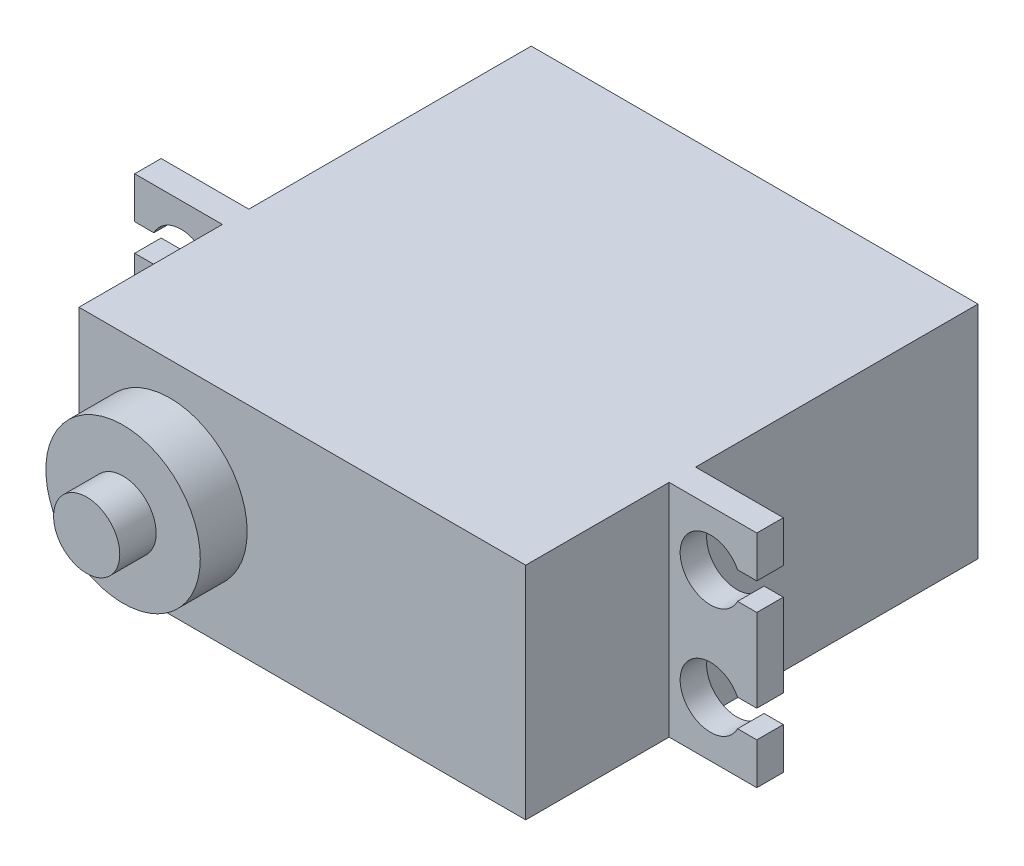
ISO-10303-21;
HEADER;
FILE_DESCRIPTION(('STEP AP214'),'2;1');
FILE_NAME('part.step','',(''),(''),'','','');
FILE_SCHEMA(('AUTOMOTIVE_DESIGN { 1 0 10303 214 1 1 1 1 }'));
ENDSEC;
DATA;
#1=APPLICATION_CONTEXT('core data for automotive mechanical design processes');
#2=APPLICATION_PROTOCOL_DEFINITION('international standard','automotive_design',2000,#1);
#3=PRODUCT_CONTEXT('',#1,'mechanical');
#4=PRODUCT('Part','Part','',(#3));
#5=PRODUCT_RELATED_PRODUCT_CATEGORY('part','',(#4));
#6=PRODUCT_DEFINITION_FORMATION('','',#4);
#7=PRODUCT_DEFINITION_CONTEXT('part definition',#1,'design');
#8=PRODUCT_DEFINITION('design','',#6,#7);
#9=PRODUCT_DEFINITION_SHAPE('','',#8);
#10=(LENGTH_UNIT() NAMED_UNIT(*) SI_UNIT(.MILLI.,.METRE.));
#11=(NAMED_UNIT(*) PLANE_ANGLE_UNIT() SI_UNIT($,.RADIAN.));
#12=(NAMED_UNIT(*) SI_UNIT($,.STERADIAN.) SOLID_ANGLE_UNIT());
#13=UNCERTAINTY_MEASURE_WITH_UNIT(LENGTH_MEASURE(1.E-05),#10,'distance_accuracy_value','');
#14=(GEOMETRIC_REPRESENTATION_CONTEXT(3) GLOBAL_UNCERTAINTY_ASSIGNED_CONTEXT((#13)) GLOBAL_UNIT_ASSIGNED_CONTEXT((#10,
#11,#12)) REPRESENTATION_CONTEXT('',''));
#15=CARTESIAN_POINT('',(0.,0.,0.));
#16=DIRECTION('',(0.,0.,1.));
#17=DIRECTION('',(1.,0.,0.));
#18=AXIS2_PLACEMENT_3D('',#15,#16,#17);
#19=CARTESIAN_POINT('',(28.2,18.3043663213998,28.));
#20=DIRECTION('',(1.,0.,0.));
#21=DIRECTION('',(0.,0.,-1.));
#22=AXIS2_PLACEMENT_3D('',#19,#20,#21);
#23=PLANE('',#22);
#24=DIRECTION('',(0.,0.,1.));
#25=VECTOR('',#24,1.);
#26=CARTESIAN_POINT('',(28.2,-3.76121968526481,0.));
#27=LINE('',#26,#25);
#28=CARTESIAN_POINT('',(28.2,-3.76121968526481,25.6));
#29=VERTEX_POINT('',#28);
#30=CARTESIAN_POINT('',(28.2,-3.76121968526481,28.));
#31=VERTEX_POINT('',#30);
#32=EDGE_CURVE('E253',#29,#31,#27,.T.);
#33=ORIENTED_EDGE('',*,*,#32,.F.);
#34=DIRECTION('',(0.,-1.,0.));
#35=VECTOR('',#34,1.);
#36=CARTESIAN_POINT('',(28.2,18.3043663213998,25.6));
#37=LINE('',#36,#35);
#38=CARTESIAN_POINT('',(28.2,3.76121968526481,25.6));
#39=VERTEX_POINT('',#38);
#40=EDGE_CURVE('E361',#39,#29,#37,.T.);
#41=ORIENTED_EDGE('',*,*,#40,.F.);
#42=DIRECTION('',(0.,0.,1.));
#43=VECTOR('',#42,1.);
#44=CARTESIAN_POINT('',(28.2,3.76121968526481,0.));
#45=LINE('',#44,#43);
#46=CARTESIAN_POINT('',(28.2,3.76121968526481,28.));
#47=VERTEX_POINT('',#46);
#48=EDGE_CURVE('E63',#39,#47,#45,.T.);
#49=ORIENTED_EDGE('',*,*,#48,.T.);
#50=DIRECTION('',(0.,-1.,0.));
#51=VECTOR('',#50,1.);
#52=CARTESIAN_POINT('',(28.2,18.3043663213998,28.));
#53=LINE('',#52,#51);
#54=EDGE_CURVE('E356',#47,#31,#53,.T.);
#55=ORIENTED_EDGE('',*,*,#54,.T.);
#56=EDGE_LOOP('',(#33,#41,#49,#55));
#57=FACE_BOUND('',#56,.T.);
#58=ADVANCED_FACE('F39',(#57),#23,.T.);
#59=DIRECTION('',(0.,0.,1.));
#60=VECTOR('',#59,1.);
#61=CARTESIAN_POINT('',(28.2,6.23878031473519,0.));
#62=LINE('',#61,#60);
#63=CARTESIAN_POINT('',(28.2,6.23878031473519,25.6));
#64=VERTEX_POINT('',#63);
#65=CARTESIAN_POINT('',(28.2,6.23878031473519,28.));
#66=VERTEX_POINT('',#65);
#67=EDGE_CURVE('E293',#64,#66,#62,.T.);
#68=ORIENTED_EDGE('',*,*,#67,.F.);
#69=CARTESIAN_POINT('',(28.2,10.,25.6));
#70=VERTEX_POINT('',#69);
#71=EDGE_CURVE('E358',#70,#64,#37,.T.);
#72=ORIENTED_EDGE('',*,*,#71,.F.);
#73=DIRECTION('',(0.,0.,-1.));
#74=VECTOR('',#73,1.);
#75=CARTESIAN_POINT('',(28.2,10.,28.));
#76=LINE('',#75,#74);
#77=CARTESIAN_POINT('',(28.2,10.,28.));
#78=VERTEX_POINT('',#77);
#79=EDGE_CURVE('E336',#78,#70,#76,.T.);
#80=ORIENTED_EDGE('',*,*,#79,.F.);
#81=EDGE_CURVE('E353',#78,#66,#53,.T.);
#82=ORIENTED_EDGE('',*,*,#81,.T.);
#83=EDGE_LOOP('',(#68,#72,#80,#82));
#84=FACE_BOUND('',#83,.T.);
#85=ADVANCED_FACE('F461',(#84),#23,.T.);
#86=CARTESIAN_POINT('',(-28.2,18.3043663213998,28.));
#87=DIRECTION('',(-1.,0.,0.));
#88=DIRECTION('',(0.,0.,1.));
#89=AXIS2_PLACEMENT_3D('',#86,#87,#88);
#90=PLANE('',#89);
#91=DIRECTION('',(0.,0.,1.));
#92=VECTOR('',#91,1.);
#93=CARTESIAN_POINT('',(-28.2,3.76121968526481,28.));
#94=LINE('',#93,#92);
#95=CARTESIAN_POINT('',(-28.2,3.76121968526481,25.6));
#96=VERTEX_POINT('',#95);
#97=CARTESIAN_POINT('',(-28.2,3.76121968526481,28.));
#98=VERTEX_POINT('',#97);
#99=EDGE_CURVE('E406',#96,#98,#94,.T.);
#100=ORIENTED_EDGE('',*,*,#99,.F.);
#101=DIRECTION('',(0.,-1.,0.));
#102=VECTOR('',#101,1.);
#103=CARTESIAN_POINT('',(-28.2,18.3043663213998,25.6));
#104=LINE('',#103,#102);
#105=CARTESIAN_POINT('',(-28.2,-3.76121968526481,25.6));
#106=VERTEX_POINT('',#105);
#107=EDGE_CURVE('E316',#96,#106,#104,.T.);
#108=ORIENTED_EDGE('',*,*,#107,.T.);
#109=DIRECTION('',(0.,0.,-1.));
#110=VECTOR('',#109,1.);
#111=CARTESIAN_POINT('',(-28.2,-3.76121968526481,28.));
#112=LINE('',#111,#110);
#113=CARTESIAN_POINT('',(-28.2,-3.76121968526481,28.));
#114=VERTEX_POINT('',#113);
#115=EDGE_CURVE('E401',#114,#106,#112,.T.);
#116=ORIENTED_EDGE('',*,*,#115,.F.);
#117=DIRECTION('',(0.,-1.,0.));
#118=VECTOR('',#117,1.);
#119=CARTESIAN_POINT('',(-28.2,18.3043663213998,28.));
#120=LINE('',#119,#118);
#121=EDGE_CURVE('E311',#98,#114,#120,.T.);
#122=ORIENTED_EDGE('',*,*,#121,.F.);
#123=EDGE_LOOP('',(#100,#108,#116,#122));
#124=FACE_BOUND('',#123,.T.);
#125=ADVANCED_FACE('F525',(#124),#90,.T.);
#126=DIRECTION('',(0.,0.,1.));
#127=VECTOR('',#126,1.);
#128=CARTESIAN_POINT('',(-28.2,-6.23878031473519,28.));
#129=LINE('',#128,#127);
#130=CARTESIAN_POINT('',(-28.2,-6.23878031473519,25.6));
#131=VERTEX_POINT('',#130);
#132=CARTESIAN_POINT('',(-28.2,-6.23878031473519,28.));
#133=VERTEX_POINT('',#132);
#134=EDGE_CURVE('E243',#131,#133,#129,.T.);
#135=ORIENTED_EDGE('',*,*,#134,.F.);
#136=CARTESIAN_POINT('',(-28.2,-10.,25.6));
#137=VERTEX_POINT('',#136);
#138=EDGE_CURVE('E317',#131,#137,#104,.T.);
#139=ORIENTED_EDGE('',*,*,#138,.T.);
#140=DIRECTION('',(0.,0.,-1.));
#141=VECTOR('',#140,1.);
#142=CARTESIAN_POINT('',(-28.2,-10.,28.));
#143=LINE('',#142,#141);
#144=CARTESIAN_POINT('',(-28.2,-10.,28.));
#145=VERTEX_POINT('',#144);
#146=EDGE_CURVE('E326',#145,#137,#143,.T.);
#147=ORIENTED_EDGE('',*,*,#146,.F.);
#148=EDGE_CURVE('E312',#133,#145,#120,.T.);
#149=ORIENTED_EDGE('',*,*,#148,.F.);
#150=EDGE_LOOP('',(#135,#139,#147,#149));
#151=FACE_BOUND('',#150,.T.);
#152=ADVANCED_FACE('F496',(#151),#90,.T.);
#153=CARTESIAN_POINT('',(-20.25,10.,41.));
#154=DIRECTION('',(1.,0.,0.));
#155=DIRECTION('',(0.,1.,0.));
#156=AXIS2_PLACEMENT_3D('',#153,#154,#155);
#157=PLANE('',#156);
#158=DIRECTION('',(0.,-1.,0.));
#159=VECTOR('',#158,1.);
#160=CARTESIAN_POINT('',(-20.25,18.3043663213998,25.6));
#161=LINE('',#160,#159);
#162=CARTESIAN_POINT('',(-20.25,10.,25.6));
#163=VERTEX_POINT('',#162);
#164=CARTESIAN_POINT('',(-20.25,-10.,25.6));
#165=VERTEX_POINT('',#164);
#166=EDGE_CURVE('E318',#163,#165,#161,.T.);
#167=ORIENTED_EDGE('',*,*,#166,.F.);
#168=DIRECTION('',(0.,0.,-1.));
#169=VECTOR('',#168,1.);
#170=CARTESIAN_POINT('',(-20.25,10.,41.));
#171=LINE('',#170,#169);
#172=CARTESIAN_POINT('',(-20.25,10.,0.));
#173=VERTEX_POINT('',#172);
#174=EDGE_CURVE('E394',#163,#173,#171,.T.);
#175=ORIENTED_EDGE('',*,*,#174,.T.);
#176=DIRECTION('',(0.,-1.,0.));
#177=VECTOR('',#176,1.);
#178=CARTESIAN_POINT('',(-20.25,10.,0.));
#179=LINE('',#178,#177);
#180=CARTESIAN_POINT('',(-20.25,-10.,0.));
#181=VERTEX_POINT('',#180);
#182=EDGE_CURVE('E383',#173,#181,#179,.T.);
#183=ORIENTED_EDGE('',*,*,#182,.T.);
#184=DIRECTION('',(0.,0.,-1.));
#185=VECTOR('',#184,1.);
#186=CARTESIAN_POINT('',(-20.25,-10.,41.));
#187=LINE('',#186,#185);
#188=EDGE_CURVE('E390',#165,#181,#187,.T.);
#189=ORIENTED_EDGE('',*,*,#188,.F.);
#190=EDGE_LOOP('',(#167,#175,#183,#189));
#191=FACE_BOUND('',#190,.T.);
#192=ADVANCED_FACE('F506',(#191),#157,.F.);
#193=CARTESIAN_POINT('',(20.25,10.,41.));
#194=DIRECTION('',(-1.,0.,0.));
#195=DIRECTION('',(0.,-1.,0.));
#196=AXIS2_PLACEMENT_3D('',#193,#194,#195);
#197=PLANE('',#196);
#198=DIRECTION('',(0.,-1.,0.));
#199=VECTOR('',#198,1.);
#200=CARTESIAN_POINT('',(20.25,18.3043663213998,28.));
#201=LINE('',#200,#199);
#202=CARTESIAN_POINT('',(20.25,10.,28.));
#203=VERTEX_POINT('',#202);
#204=CARTESIAN_POINT('',(20.25,-10.,28.));
#205=VERTEX_POINT('',#204);
#206=EDGE_CURVE('E339',#203,#205,#201,.T.);
#207=ORIENTED_EDGE('',*,*,#206,.F.);
#208=DIRECTION('',(0.,0.,-1.));
#209=VECTOR('',#208,1.);
#210=CARTESIAN_POINT('',(20.25,10.,41.));
#211=LINE('',#210,#209);
#212=CARTESIAN_POINT('',(20.25,10.,41.));
#213=VERTEX_POINT('',#212);
#214=EDGE_CURVE('E398',#213,#203,#211,.T.);
#215=ORIENTED_EDGE('',*,*,#214,.F.);
#216=DIRECTION('',(0.,1.,0.));
#217=VECTOR('',#216,1.);
#218=CARTESIAN_POINT('',(20.25,10.,41.));
#219=LINE('',#218,#217);
#220=CARTESIAN_POINT('',(20.25,-10.,41.));
#221=VERTEX_POINT('',#220);
#222=EDGE_CURVE('E367',#221,#213,#219,.T.);
#223=ORIENTED_EDGE('',*,*,#222,.F.);
#224=DIRECTION('',(0.,0.,-1.));
#225=VECTOR('',#224,1.);
#226=CARTESIAN_POINT('',(20.25,-10.,41.));
#227=LINE('',#226,#225);
#228=EDGE_CURVE('E388',#221,#205,#227,.T.);
#229=ORIENTED_EDGE('',*,*,#228,.T.);
#230=EDGE_LOOP('',(#207,#215,#223,#229));
#231=FACE_BOUND('',#230,.T.);
#232=ADVANCED_FACE('F483',(#231),#197,.F.);
#233=CARTESIAN_POINT('',(20.25,10.,25.6));
#234=VERTEX_POINT('',#233);
#235=CARTESIAN_POINT('',(20.25,10.,0.));
#236=VERTEX_POINT('',#235);
#237=EDGE_CURVE('E397',#234,#236,#211,.T.);
#238=ORIENTED_EDGE('',*,*,#237,.F.);
#239=DIRECTION('',(0.,-1.,0.));
#240=VECTOR('',#239,1.);
#241=CARTESIAN_POINT('',(20.25,18.3043663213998,25.6));
#242=LINE('',#241,#240);
#243=CARTESIAN_POINT('',(20.25,-10.,25.6));
#244=VERTEX_POINT('',#243);
#245=EDGE_CURVE('E350',#234,#244,#242,.T.);
#246=ORIENTED_EDGE('',*,*,#245,.T.);
#247=CARTESIAN_POINT('',(20.25,-10.,0.));
#248=VERTEX_POINT('',#247);
#249=EDGE_CURVE('E377',#244,#248,#227,.T.);
#250=ORIENTED_EDGE('',*,*,#249,.T.);
#251=DIRECTION('',(0.,1.,0.));
#252=VECTOR('',#251,1.);
#253=CARTESIAN_POINT('',(20.25,10.,0.));
#254=LINE('',#253,#252);
#255=EDGE_CURVE('E366',#248,#236,#254,.T.);
#256=ORIENTED_EDGE('',*,*,#255,.T.);
#257=EDGE_LOOP('',(#238,#246,#250,#256));
#258=FACE_BOUND('',#257,.T.);
#259=ADVANCED_FACE('F41',(#258),#197,.F.);
#260=CARTESIAN_POINT('',(-20.25,10.,41.));
#261=DIRECTION('',(0.,-1.,0.));
#262=DIRECTION('',(0.,0.,-1.));
#263=AXIS2_PLACEMENT_3D('',#260,#261,#262);
#264=PLANE('',#263);
#265=DIRECTION('',(-1.,0.,0.));
#266=VECTOR('',#265,1.);
#267=CARTESIAN_POINT('',(-20.25,10.,0.));
#268=LINE('',#267,#266);
#269=EDGE_CURVE('E380',#236,#173,#268,.T.);
#270=ORIENTED_EDGE('',*,*,#269,.T.);
#271=ORIENTED_EDGE('',*,*,#174,.F.);
#272=DIRECTION('',(-1.,0.,0.));
#273=VECTOR('',#272,1.);
#274=CARTESIAN_POINT('',(-20.25,10.,25.6));
#275=LINE('',#274,#273);
#276=CARTESIAN_POINT('',(-28.2,10.,25.6));
#277=VERTEX_POINT('',#276);
#278=EDGE_CURVE('E323',#163,#277,#275,.T.);
#279=ORIENTED_EDGE('',*,*,#278,.T.);
#280=DIRECTION('',(0.,0.,1.));
#281=VECTOR('',#280,1.);
#282=CARTESIAN_POINT('',(-28.2,10.,28.));
#283=LINE('',#282,#281);
#284=CARTESIAN_POINT('',(-28.2,10.,28.));
#285=VERTEX_POINT('',#284);
#286=EDGE_CURVE('E304',#277,#285,#283,.T.);
#287=ORIENTED_EDGE('',*,*,#286,.T.);
#288=DIRECTION('',(1.,0.,0.));
#289=VECTOR('',#288,1.);
#290=CARTESIAN_POINT('',(-20.25,10.,28.));
#291=LINE('',#290,#289);
#292=CARTESIAN_POINT('',(-20.25,10.,28.));
#293=VERTEX_POINT('',#292);
#294=EDGE_CURVE('E306',#285,#293,#291,.T.);
#295=ORIENTED_EDGE('',*,*,#294,.T.);
#296=CARTESIAN_POINT('',(-20.25,10.,41.));
#297=VERTEX_POINT('',#296);
#298=EDGE_CURVE('E395',#297,#293,#171,.T.);
#299=ORIENTED_EDGE('',*,*,#298,.F.);
#300=DIRECTION('',(-1.,0.,0.));
#301=VECTOR('',#300,1.);
#302=CARTESIAN_POINT('',(-20.25,10.,41.));
#303=LINE('',#302,#301);
#304=EDGE_CURVE('E370',#213,#297,#303,.T.);
#305=ORIENTED_EDGE('',*,*,#304,.F.);
#306=ORIENTED_EDGE('',*,*,#214,.T.);
#307=DIRECTION('',(1.,0.,0.));
#308=VECTOR('',#307,1.);
#309=CARTESIAN_POINT('',(20.25,10.,28.));
#310=LINE('',#309,#308);
#311=EDGE_CURVE('E338',#203,#78,#310,.T.);
#312=ORIENTED_EDGE('',*,*,#311,.T.);
#313=ORIENTED_EDGE('',*,*,#79,.T.);
#314=DIRECTION('',(-1.,0.,0.));
#315=VECTOR('',#314,1.);
#316=CARTESIAN_POINT('',(20.25,10.,25.6));
#317=LINE('',#316,#315);
#318=EDGE_CURVE('E341',#70,#234,#317,.T.);
#319=ORIENTED_EDGE('',*,*,#318,.T.);
#320=ORIENTED_EDGE('',*,*,#237,.T.);
#321=EDGE_LOOP('',(#270,#271,#279,#287,#295,#299,#305,#306,#312,#313,#319,#320));
#322=FACE_BOUND('',#321,.T.);
#323=ADVANCED_FACE('F454',(#322),#264,.F.);
#324=ORIENTED_EDGE('',*,*,#298,.T.);
#325=DIRECTION('',(0.,-1.,0.));
#326=VECTOR('',#325,1.);
#327=CARTESIAN_POINT('',(-20.25,18.3043663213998,28.));
#328=LINE('',#327,#326);
#329=CARTESIAN_POINT('',(-20.25,-10.,28.));
#330=VERTEX_POINT('',#329);
#331=EDGE_CURVE('E321',#293,#330,#328,.T.);
#332=ORIENTED_EDGE('',*,*,#331,.T.);
#333=CARTESIAN_POINT('',(-20.25,-10.,41.));
#334=VERTEX_POINT('',#333);
#335=EDGE_CURVE('E391',#334,#330,#187,.T.);
#336=ORIENTED_EDGE('',*,*,#335,.F.);
#337=DIRECTION('',(0.,-1.,0.));
#338=VECTOR('',#337,1.);
#339=CARTESIAN_POINT('',(-20.25,10.,41.));
#340=LINE('',#339,#338);
#341=EDGE_CURVE('E373',#297,#334,#340,.T.);
#342=ORIENTED_EDGE('',*,*,#341,.F.);
#343=EDGE_LOOP('',(#324,#332,#336,#342));
#344=FACE_BOUND('',#343,.T.);
#345=ADVANCED_FACE('F490',(#344),#157,.F.);
#346=CARTESIAN_POINT('',(-20.25,-10.,41.));
#347=DIRECTION('',(0.,1.,0.));
#348=DIRECTION('',(0.,0.,1.));
#349=AXIS2_PLACEMENT_3D('',#346,#347,#348);
#350=PLANE('',#349);
#351=DIRECTION('',(1.,0.,0.));
#352=VECTOR('',#351,1.);
#353=CARTESIAN_POINT('',(-20.25,-10.,0.));
#354=LINE('',#353,#352);
#355=EDGE_CURVE('E371',#181,#248,#354,.T.);
#356=ORIENTED_EDGE('',*,*,#355,.T.);
#357=ORIENTED_EDGE('',*,*,#249,.F.);
#358=DIRECTION('',(1.,0.,0.));
#359=VECTOR('',#358,1.);
#360=CARTESIAN_POINT('',(20.25,-10.,25.6));
#361=LINE('',#360,#359);
#362=CARTESIAN_POINT('',(28.2,-10.,25.6));
#363=VERTEX_POINT('',#362);
#364=EDGE_CURVE('E332',#244,#363,#361,.T.);
#365=ORIENTED_EDGE('',*,*,#364,.T.);
#366=DIRECTION('',(0.,0.,1.));
#367=VECTOR('',#366,1.);
#368=CARTESIAN_POINT('',(28.2,-10.,28.));
#369=LINE('',#368,#367);
#370=CARTESIAN_POINT('',(28.2,-10.,28.));
#371=VERTEX_POINT('',#370);
#372=EDGE_CURVE('E344',#363,#371,#369,.T.);
#373=ORIENTED_EDGE('',*,*,#372,.T.);
#374=DIRECTION('',(-1.,0.,0.));
#375=VECTOR('',#374,1.);
#376=CARTESIAN_POINT('',(20.25,-10.,28.));
#377=LINE('',#376,#375);
#378=EDGE_CURVE('E347',#371,#205,#377,.T.);
#379=ORIENTED_EDGE('',*,*,#378,.T.);
#380=ORIENTED_EDGE('',*,*,#228,.F.);
#381=DIRECTION('',(1.,0.,0.));
#382=VECTOR('',#381,1.);
#383=CARTESIAN_POINT('',(-20.25,-10.,41.));
#384=LINE('',#383,#382);
#385=EDGE_CURVE('E375',#334,#221,#384,.T.);
#386=ORIENTED_EDGE('',*,*,#385,.F.);
#387=ORIENTED_EDGE('',*,*,#335,.T.);
#388=DIRECTION('',(-1.,0.,0.));
#389=VECTOR('',#388,1.);
#390=CARTESIAN_POINT('',(-20.25,-10.,28.));
#391=LINE('',#390,#389);
#392=EDGE_CURVE('E329',#330,#145,#391,.T.);
#393=ORIENTED_EDGE('',*,*,#392,.T.);
#394=ORIENTED_EDGE('',*,*,#146,.T.);
#395=DIRECTION('',(1.,0.,0.));
#396=VECTOR('',#395,1.);
#397=CARTESIAN_POINT('',(-20.25,-10.,25.6));
#398=LINE('',#397,#396);
#399=EDGE_CURVE('E310',#137,#165,#398,.T.);
#400=ORIENTED_EDGE('',*,*,#399,.T.);
#401=ORIENTED_EDGE('',*,*,#188,.T.);
#402=EDGE_LOOP('',(#356,#357,#365,#373,#379,#380,#386,#387,#393,#394,#400,#401));
#403=FACE_BOUND('',#402,.T.);
#404=ADVANCED_FACE('F446',(#403),#350,.F.);
#405=CARTESIAN_POINT('',(0.,0.,41.));
#406=DIRECTION('',(0.,0.,1.));
#407=DIRECTION('',(1.,0.,0.));
#408=AXIS2_PLACEMENT_3D('',#405,#406,#407);
#409=PLANE('',#408);
#410=CARTESIAN_POINT('',(-12.,0.,41.));
#411=DIRECTION('',(0.,0.,1.));
#412=DIRECTION('',(1.,0.,0.));
#413=AXIS2_PLACEMENT_3D('',#410,#411,#412);
#414=CIRCLE('',#413,7.);
#415=CARTESIAN_POINT('',(-5.,0.,41.));
#416=VERTEX_POINT('',#415);
#417=EDGE_CURVE('E856',#416,#416,#414,.T.);
#418=ORIENTED_EDGE('',*,*,#417,.F.);
#419=EDGE_LOOP('',(#418));
#420=FACE_BOUND('',#419,.T.);
#421=ORIENTED_EDGE('',*,*,#222,.T.);
#422=ORIENTED_EDGE('',*,*,#304,.T.);
#423=ORIENTED_EDGE('',*,*,#341,.T.);
#424=ORIENTED_EDGE('',*,*,#385,.T.);
#425=EDGE_LOOP('',(#421,#422,#423,#424));
#426=FACE_BOUND('',#425,.T.);
#427=ADVANCED_FACE('F485',(#420,#426),#409,.T.);
#428=CARTESIAN_POINT('',(0.,0.,0.));
#429=DIRECTION('',(0.,0.,1.));
#430=DIRECTION('',(1.,0.,0.));
#431=AXIS2_PLACEMENT_3D('',#428,#429,#430);
#432=PLANE('',#431);
#433=ORIENTED_EDGE('',*,*,#255,.F.);
#434=ORIENTED_EDGE('',*,*,#355,.F.);
#435=ORIENTED_EDGE('',*,*,#182,.F.);
#436=ORIENTED_EDGE('',*,*,#269,.F.);
#437=EDGE_LOOP('',(#433,#434,#435,#436));
#438=FACE_BOUND('',#437,.T.);
#439=ADVANCED_FACE('F509',(#438),#432,.F.);
#440=CARTESIAN_POINT('',(20.25,18.3043663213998,28.));
#441=DIRECTION('',(0.,0.,1.));
#442=DIRECTION('',(1.,0.,0.));
#443=AXIS2_PLACEMENT_3D('',#440,#441,#442);
#444=PLANE('',#443);
#445=DIRECTION('',(-1.,0.,0.));
#446=VECTOR('',#445,1.);
#447=CARTESIAN_POINT('',(26.4551829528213,-3.76121968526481,28.));
#448=LINE('',#447,#446);
#449=CARTESIAN_POINT('',(26.4551829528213,-3.76121968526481,28.));
#450=VERTEX_POINT('',#449);
#451=EDGE_CURVE('E273',#31,#450,#448,.T.);
#452=ORIENTED_EDGE('',*,*,#451,.F.);
#453=ORIENTED_EDGE('',*,*,#54,.F.);
#454=DIRECTION('',(1.,0.,0.));
#455=VECTOR('',#454,1.);
#456=CARTESIAN_POINT('',(26.4551829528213,3.76121968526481,28.));
#457=LINE('',#456,#455);
#458=CARTESIAN_POINT('',(26.4551829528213,3.76121968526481,28.));
#459=VERTEX_POINT('',#458);
#460=EDGE_CURVE('E284',#459,#47,#457,.T.);
#461=ORIENTED_EDGE('',*,*,#460,.F.);
#462=CARTESIAN_POINT('',(24.,5.00000000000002,28.));
#463=DIRECTION('',(0.,0.,1.));
#464=DIRECTION('',(-1.,0.,0.));
#465=AXIS2_PLACEMENT_3D('',#462,#463,#464);
#466=CIRCLE('',#465,2.75);
#467=CARTESIAN_POINT('',(26.4551829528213,6.23878031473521,28.));
#468=VERTEX_POINT('',#467);
#469=EDGE_CURVE('E270',#468,#459,#466,.T.);
#470=ORIENTED_EDGE('',*,*,#469,.F.);
#471=DIRECTION('',(-1.,0.,0.));
#472=VECTOR('',#471,1.);
#473=CARTESIAN_POINT('',(26.4551829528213,6.23878031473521,28.));
#474=LINE('',#473,#472);
#475=EDGE_CURVE('E286',#66,#468,#474,.T.);
#476=ORIENTED_EDGE('',*,*,#475,.F.);
#477=ORIENTED_EDGE('',*,*,#81,.F.);
#478=ORIENTED_EDGE('',*,*,#311,.F.);
#479=ORIENTED_EDGE('',*,*,#206,.T.);
#480=ORIENTED_EDGE('',*,*,#378,.F.);
#481=CARTESIAN_POINT('',(28.2,-6.23878031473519,28.));
#482=VERTEX_POINT('',#481);
#483=EDGE_CURVE('E357',#482,#371,#53,.T.);
#484=ORIENTED_EDGE('',*,*,#483,.F.);
#485=DIRECTION('',(1.,0.,0.));
#486=VECTOR('',#485,1.);
#487=CARTESIAN_POINT('',(26.4551829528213,-6.23878031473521,28.));
#488=LINE('',#487,#486);
#489=CARTESIAN_POINT('',(26.4551829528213,-6.23878031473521,28.));
#490=VERTEX_POINT('',#489);
#491=EDGE_CURVE('E278',#490,#482,#488,.T.);
#492=ORIENTED_EDGE('',*,*,#491,.F.);
#493=CARTESIAN_POINT('',(24.,-4.99999999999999,28.));
#494=DIRECTION('',(0.,0.,1.));
#495=DIRECTION('',(1.,0.,0.));
#496=AXIS2_PLACEMENT_3D('',#493,#494,#495);
#497=CIRCLE('',#496,2.74999999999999);
#498=EDGE_CURVE('E262',#450,#490,#497,.T.);
#499=ORIENTED_EDGE('',*,*,#498,.F.);
#500=EDGE_LOOP('',(#452,#453,#461,#470,#476,#477,#478,#479,#480,#484,#492,#499));
#501=FACE_BOUND('',#500,.T.);
#502=ADVANCED_FACE('F468',(#501),#444,.T.);
#503=DIRECTION('',(0.,0.,1.));
#504=VECTOR('',#503,1.);
#505=CARTESIAN_POINT('',(28.2,-6.23878031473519,0.));
#506=LINE('',#505,#504);
#507=CARTESIAN_POINT('',(28.2,-6.2387803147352,25.6));
#508=VERTEX_POINT('',#507);
#509=EDGE_CURVE('E55',#508,#482,#506,.T.);
#510=ORIENTED_EDGE('',*,*,#509,.T.);
#511=ORIENTED_EDGE('',*,*,#483,.T.);
#512=ORIENTED_EDGE('',*,*,#372,.F.);
#513=EDGE_CURVE('E362',#508,#363,#37,.T.);
#514=ORIENTED_EDGE('',*,*,#513,.F.);
#515=EDGE_LOOP('',(#510,#511,#512,#514));
#516=FACE_BOUND('',#515,.T.);
#517=ADVANCED_FACE('F441',(#516),#23,.T.);
#518=CARTESIAN_POINT('',(20.25,18.3043663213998,25.6));
#519=DIRECTION('',(0.,0.,-1.));
#520=DIRECTION('',(-1.,0.,0.));
#521=AXIS2_PLACEMENT_3D('',#518,#519,#520);
#522=PLANE('',#521);
#523=DIRECTION('',(1.,0.,0.));
#524=VECTOR('',#523,1.);
#525=CARTESIAN_POINT('',(20.25,-3.76121968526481,25.6));
#526=LINE('',#525,#524);
#527=CARTESIAN_POINT('',(26.4551829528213,-3.76121968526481,25.6));
#528=VERTEX_POINT('',#527);
#529=EDGE_CURVE('E43',#528,#29,#526,.T.);
#530=ORIENTED_EDGE('',*,*,#529,.F.);
#531=CARTESIAN_POINT('',(24.,-4.99999999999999,25.6));
#532=DIRECTION('',(0.,0.,-1.));
#533=DIRECTION('',(-1.,0.,0.));
#534=AXIS2_PLACEMENT_3D('',#531,#532,#533);
#535=CIRCLE('',#534,2.74999999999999);
#536=CARTESIAN_POINT('',(26.4551829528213,-6.23878031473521,25.6));
#537=VERTEX_POINT('',#536);
#538=EDGE_CURVE('E418',#537,#528,#535,.T.);
#539=ORIENTED_EDGE('',*,*,#538,.F.);
#540=DIRECTION('',(-1.,0.,0.));
#541=VECTOR('',#540,1.);
#542=CARTESIAN_POINT('',(20.2500000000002,-6.23878031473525,25.6));
#543=LINE('',#542,#541);
#544=EDGE_CURVE('E417',#508,#537,#543,.T.);
#545=ORIENTED_EDGE('',*,*,#544,.F.);
#546=ORIENTED_EDGE('',*,*,#513,.T.);
#547=ORIENTED_EDGE('',*,*,#364,.F.);
#548=ORIENTED_EDGE('',*,*,#245,.F.);
#549=ORIENTED_EDGE('',*,*,#318,.F.);
#550=ORIENTED_EDGE('',*,*,#71,.T.);
#551=DIRECTION('',(1.,0.,0.));
#552=VECTOR('',#551,1.);
#553=CARTESIAN_POINT('',(20.2499999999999,6.23878031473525,25.6));
#554=LINE('',#553,#552);
#555=CARTESIAN_POINT('',(26.4551829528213,6.23878031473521,25.6));
#556=VERTEX_POINT('',#555);
#557=EDGE_CURVE('E415',#556,#64,#554,.T.);
#558=ORIENTED_EDGE('',*,*,#557,.F.);
#559=CARTESIAN_POINT('',(24.,5.00000000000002,25.6));
#560=DIRECTION('',(0.,0.,-1.));
#561=DIRECTION('',(-1.,0.,0.));
#562=AXIS2_PLACEMENT_3D('',#559,#560,#561);
#563=CIRCLE('',#562,2.75);
#564=CARTESIAN_POINT('',(26.4551829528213,3.76121968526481,25.6));
#565=VERTEX_POINT('',#564);
#566=EDGE_CURVE('E413',#565,#556,#563,.T.);
#567=ORIENTED_EDGE('',*,*,#566,.F.);
#568=DIRECTION('',(-1.,0.,0.));
#569=VECTOR('',#568,1.);
#570=CARTESIAN_POINT('',(20.25,3.76121968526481,25.6));
#571=LINE('',#570,#569);
#572=EDGE_CURVE('E411',#39,#565,#571,.T.);
#573=ORIENTED_EDGE('',*,*,#572,.F.);
#574=ORIENTED_EDGE('',*,*,#40,.T.);
#575=EDGE_LOOP('',(#530,#539,#545,#546,#547,#548,#549,#550,#558,#567,#573,#574));
#576=FACE_BOUND('',#575,.T.);
#577=ADVANCED_FACE('F434',(#576),#522,.T.);
#578=CARTESIAN_POINT('',(-20.25,18.3043663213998,28.));
#579=DIRECTION('',(0.,0.,1.));
#580=DIRECTION('',(1.,0.,0.));
#581=AXIS2_PLACEMENT_3D('',#578,#579,#580);
#582=PLANE('',#581);
#583=DIRECTION('',(1.,0.,0.));
#584=VECTOR('',#583,1.);
#585=CARTESIAN_POINT('',(-26.4551829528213,3.7612196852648,28.));
#586=LINE('',#585,#584);
#587=CARTESIAN_POINT('',(-26.4551829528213,3.7612196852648,28.));
#588=VERTEX_POINT('',#587);
#589=EDGE_CURVE('E259',#98,#588,#586,.T.);
#590=ORIENTED_EDGE('',*,*,#589,.F.);
#591=ORIENTED_EDGE('',*,*,#121,.T.);
#592=DIRECTION('',(-1.,0.,0.));
#593=VECTOR('',#592,1.);
#594=CARTESIAN_POINT('',(-26.4551829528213,-3.76121968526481,28.));
#595=LINE('',#594,#593);
#596=CARTESIAN_POINT('',(-26.4551829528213,-3.76121968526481,28.));
#597=VERTEX_POINT('',#596);
#598=EDGE_CURVE('E246',#597,#114,#595,.T.);
#599=ORIENTED_EDGE('',*,*,#598,.F.);
#600=CARTESIAN_POINT('',(-24.,-5.,28.));
#601=DIRECTION('',(0.,0.,1.));
#602=DIRECTION('',(-1.,0.,0.));
#603=AXIS2_PLACEMENT_3D('',#600,#601,#602);
#604=CIRCLE('',#603,2.74999999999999);
#605=CARTESIAN_POINT('',(-26.4551829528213,-6.23878031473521,28.));
#606=VERTEX_POINT('',#605);
#607=EDGE_CURVE('E230',#606,#597,#604,.T.);
#608=ORIENTED_EDGE('',*,*,#607,.F.);
#609=DIRECTION('',(1.,0.,0.));
#610=VECTOR('',#609,1.);
#611=CARTESIAN_POINT('',(-26.4551829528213,-6.23878031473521,28.));
#612=LINE('',#611,#610);
#613=EDGE_CURVE('E240',#133,#606,#612,.T.);
#614=ORIENTED_EDGE('',*,*,#613,.F.);
#615=ORIENTED_EDGE('',*,*,#148,.T.);
#616=ORIENTED_EDGE('',*,*,#392,.F.);
#617=ORIENTED_EDGE('',*,*,#331,.F.);
#618=ORIENTED_EDGE('',*,*,#294,.F.);
#619=CARTESIAN_POINT('',(-28.2,6.2387803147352,28.));
#620=VERTEX_POINT('',#619);
#621=EDGE_CURVE('E307',#285,#620,#120,.T.);
#622=ORIENTED_EDGE('',*,*,#621,.T.);
#623=DIRECTION('',(-1.,0.,0.));
#624=VECTOR('',#623,1.);
#625=CARTESIAN_POINT('',(-26.4551829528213,6.2387803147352,28.));
#626=LINE('',#625,#624);
#627=CARTESIAN_POINT('',(-26.4551829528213,6.2387803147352,28.));
#628=VERTEX_POINT('',#627);
#629=EDGE_CURVE('E265',#628,#620,#626,.T.);
#630=ORIENTED_EDGE('',*,*,#629,.F.);
#631=CARTESIAN_POINT('',(-24.,5.,28.));
#632=DIRECTION('',(0.,0.,1.));
#633=DIRECTION('',(1.,0.,0.));
#634=AXIS2_PLACEMENT_3D('',#631,#632,#633);
#635=CIRCLE('',#634,2.75);
#636=EDGE_CURVE('E267',#588,#628,#635,.T.);
#637=ORIENTED_EDGE('',*,*,#636,.F.);
#638=EDGE_LOOP('',(#590,#591,#599,#608,#614,#615,#616,#617,#618,#622,#630,#637));
#639=FACE_BOUND('',#638,.T.);
#640=ADVANCED_FACE('F249',(#639),#582,.T.);
#641=CARTESIAN_POINT('',(-20.25,18.3043663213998,25.6));
#642=DIRECTION('',(0.,0.,-1.));
#643=DIRECTION('',(-1.,0.,0.));
#644=AXIS2_PLACEMENT_3D('',#641,#642,#643);
#645=PLANE('',#644);
#646=DIRECTION('',(-1.,0.,0.));
#647=VECTOR('',#646,1.);
#648=CARTESIAN_POINT('',(-20.2500000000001,3.76121968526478,25.6));
#649=LINE('',#648,#647);
#650=CARTESIAN_POINT('',(-26.4551829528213,3.7612196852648,25.6));
#651=VERTEX_POINT('',#650);
#652=EDGE_CURVE('E302',#651,#96,#649,.T.);
#653=ORIENTED_EDGE('',*,*,#652,.F.);
#654=CARTESIAN_POINT('',(-24.,5.,25.6));
#655=DIRECTION('',(0.,0.,-1.));
#656=DIRECTION('',(-1.,0.,0.));
#657=AXIS2_PLACEMENT_3D('',#654,#655,#656);
#658=CIRCLE('',#657,2.75);
#659=CARTESIAN_POINT('',(-26.4551829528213,6.2387803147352,25.6));
#660=VERTEX_POINT('',#659);
#661=EDGE_CURVE('E409',#660,#651,#658,.T.);
#662=ORIENTED_EDGE('',*,*,#661,.F.);
#663=DIRECTION('',(1.,0.,0.));
#664=VECTOR('',#663,1.);
#665=CARTESIAN_POINT('',(-20.25,6.23878031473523,25.6));
#666=LINE('',#665,#664);
#667=CARTESIAN_POINT('',(-28.2,6.23878031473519,25.6));
#668=VERTEX_POINT('',#667);
#669=EDGE_CURVE('E300',#668,#660,#666,.T.);
#670=ORIENTED_EDGE('',*,*,#669,.F.);
#671=EDGE_CURVE('E313',#277,#668,#104,.T.);
#672=ORIENTED_EDGE('',*,*,#671,.F.);
#673=ORIENTED_EDGE('',*,*,#278,.F.);
#674=ORIENTED_EDGE('',*,*,#166,.T.);
#675=ORIENTED_EDGE('',*,*,#399,.F.);
#676=ORIENTED_EDGE('',*,*,#138,.F.);
#677=DIRECTION('',(-1.,0.,0.));
#678=VECTOR('',#677,1.);
#679=CARTESIAN_POINT('',(-20.2500000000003,-6.23878031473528,25.6));
#680=LINE('',#679,#678);
#681=CARTESIAN_POINT('',(-26.4551829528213,-6.23878031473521,25.6));
#682=VERTEX_POINT('',#681);
#683=EDGE_CURVE('E298',#682,#131,#680,.T.);
#684=ORIENTED_EDGE('',*,*,#683,.F.);
#685=CARTESIAN_POINT('',(-24.,-5.,25.6));
#686=DIRECTION('',(0.,0.,-1.));
#687=DIRECTION('',(-1.,0.,0.));
#688=AXIS2_PLACEMENT_3D('',#685,#686,#687);
#689=CIRCLE('',#688,2.74999999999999);
#690=CARTESIAN_POINT('',(-26.4551829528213,-3.76121968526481,25.6));
#691=VERTEX_POINT('',#690);
#692=EDGE_CURVE('E233',#691,#682,#689,.T.);
#693=ORIENTED_EDGE('',*,*,#692,.F.);
#694=DIRECTION('',(1.,0.,0.));
#695=VECTOR('',#694,1.);
#696=CARTESIAN_POINT('',(-20.2500000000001,-3.76121968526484,25.6));
#697=LINE('',#696,#695);
#698=EDGE_CURVE('E292',#106,#691,#697,.T.);
#699=ORIENTED_EDGE('',*,*,#698,.F.);
#700=ORIENTED_EDGE('',*,*,#107,.F.);
#701=EDGE_LOOP('',(#653,#662,#670,#672,#673,#674,#675,#676,#684,#693,#699,#700));
#702=FACE_BOUND('',#701,.T.);
#703=ADVANCED_FACE('F501',(#702),#645,.T.);
#704=DIRECTION('',(0.,0.,-1.));
#705=VECTOR('',#704,1.);
#706=CARTESIAN_POINT('',(-28.2,6.23878031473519,28.));
#707=LINE('',#706,#705);
#708=EDGE_CURVE('E404',#620,#668,#707,.T.);
#709=ORIENTED_EDGE('',*,*,#708,.F.);
#710=ORIENTED_EDGE('',*,*,#621,.F.);
#711=ORIENTED_EDGE('',*,*,#286,.F.);
#712=ORIENTED_EDGE('',*,*,#671,.T.);
#713=EDGE_LOOP('',(#709,#710,#711,#712));
#714=FACE_BOUND('',#713,.T.);
#715=ADVANCED_FACE('F538',(#714),#90,.T.);
#716=CARTESIAN_POINT('',(-24.,-5.,0.));
#717=DIRECTION('',(0.,0.,1.));
#718=DIRECTION('',(1.,0.,0.));
#719=AXIS2_PLACEMENT_3D('',#716,#717,#718);
#720=CYLINDRICAL_SURFACE('',#719,2.74999999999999);
#721=ORIENTED_EDGE('',*,*,#692,.T.);
#722=DIRECTION('',(0.,0.,1.));
#723=VECTOR('',#722,1.);
#724=CARTESIAN_POINT('',(-26.4551829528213,-6.23878031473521,0.));
#725=LINE('',#724,#723);
#726=EDGE_CURVE('E225',#682,#606,#725,.T.);
#727=ORIENTED_EDGE('',*,*,#726,.T.);
#728=ORIENTED_EDGE('',*,*,#607,.T.);
#729=DIRECTION('',(0.,0.,1.));
#730=VECTOR('',#729,1.);
#731=CARTESIAN_POINT('',(-26.4551829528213,-3.76121968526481,0.));
#732=LINE('',#731,#730);
#733=EDGE_CURVE('E236',#691,#597,#732,.T.);
#734=ORIENTED_EDGE('',*,*,#733,.F.);
#735=EDGE_LOOP('',(#721,#727,#728,#734));
#736=FACE_BOUND('',#735,.T.);
#737=ADVANCED_FACE('F227',(#736),#720,.F.);
#738=CARTESIAN_POINT('',(-26.4551829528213,-6.23878031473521,0.));
#739=DIRECTION('',(0.,-1.,0.));
#740=DIRECTION('',(1.,0.,0.));
#741=AXIS2_PLACEMENT_3D('',#738,#739,#740);
#742=PLANE('',#741);
#743=ORIENTED_EDGE('',*,*,#683,.T.);
#744=ORIENTED_EDGE('',*,*,#134,.T.);
#745=ORIENTED_EDGE('',*,*,#613,.T.);
#746=ORIENTED_EDGE('',*,*,#726,.F.);
#747=EDGE_LOOP('',(#743,#744,#745,#746));
#748=FACE_BOUND('',#747,.T.);
#749=ADVANCED_FACE('F241',(#748),#742,.F.);
#750=CARTESIAN_POINT('',(-26.4551829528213,-3.76121968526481,0.));
#751=DIRECTION('',(0.,1.,0.));
#752=DIRECTION('',(-1.,0.,0.));
#753=AXIS2_PLACEMENT_3D('',#750,#751,#752);
#754=PLANE('',#753);
#755=ORIENTED_EDGE('',*,*,#698,.T.);
#756=ORIENTED_EDGE('',*,*,#733,.T.);
#757=ORIENTED_EDGE('',*,*,#598,.T.);
#758=ORIENTED_EDGE('',*,*,#115,.T.);
#759=EDGE_LOOP('',(#755,#756,#757,#758));
#760=FACE_BOUND('',#759,.T.);
#761=ADVANCED_FACE('F695',(#760),#754,.F.);
#762=CARTESIAN_POINT('',(-24.,5.,0.));
#763=DIRECTION('',(0.,0.,1.));
#764=DIRECTION('',(1.,0.,0.));
#765=AXIS2_PLACEMENT_3D('',#762,#763,#764);
#766=CYLINDRICAL_SURFACE('',#765,2.75);
#767=ORIENTED_EDGE('',*,*,#661,.T.);
#768=DIRECTION('',(0.,0.,1.));
#769=VECTOR('',#768,1.);
#770=CARTESIAN_POINT('',(-26.4551829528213,3.7612196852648,0.));
#771=LINE('',#770,#769);
#772=EDGE_CURVE('E260',#651,#588,#771,.T.);
#773=ORIENTED_EDGE('',*,*,#772,.T.);
#774=ORIENTED_EDGE('',*,*,#636,.T.);
#775=DIRECTION('',(0.,0.,1.));
#776=VECTOR('',#775,1.);
#777=CARTESIAN_POINT('',(-26.4551829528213,6.2387803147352,0.));
#778=LINE('',#777,#776);
#779=EDGE_CURVE('E257',#660,#628,#778,.T.);
#780=ORIENTED_EDGE('',*,*,#779,.F.);
#781=EDGE_LOOP('',(#767,#773,#774,#780));
#782=FACE_BOUND('',#781,.T.);
#783=ADVANCED_FACE('F705',(#782),#766,.F.);
#784=CARTESIAN_POINT('',(-26.4551829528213,3.7612196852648,0.));
#785=DIRECTION('',(0.,-1.,0.));
#786=DIRECTION('',(1.,0.,0.));
#787=AXIS2_PLACEMENT_3D('',#784,#785,#786);
#788=PLANE('',#787);
#789=ORIENTED_EDGE('',*,*,#652,.T.);
#790=ORIENTED_EDGE('',*,*,#99,.T.);
#791=ORIENTED_EDGE('',*,*,#589,.T.);
#792=ORIENTED_EDGE('',*,*,#772,.F.);
#793=EDGE_LOOP('',(#789,#790,#791,#792));
#794=FACE_BOUND('',#793,.T.);
#795=ADVANCED_FACE('F716',(#794),#788,.F.);
#796=CARTESIAN_POINT('',(-26.4551829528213,6.2387803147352,0.));
#797=DIRECTION('',(0.,1.,0.));
#798=DIRECTION('',(-1.,0.,0.));
#799=AXIS2_PLACEMENT_3D('',#796,#797,#798);
#800=PLANE('',#799);
#801=ORIENTED_EDGE('',*,*,#669,.T.);
#802=ORIENTED_EDGE('',*,*,#779,.T.);
#803=ORIENTED_EDGE('',*,*,#629,.T.);
#804=ORIENTED_EDGE('',*,*,#708,.T.);
#805=EDGE_LOOP('',(#801,#802,#803,#804));
#806=FACE_BOUND('',#805,.T.);
#807=ADVANCED_FACE('F727',(#806),#800,.F.);
#808=CARTESIAN_POINT('',(24.,5.00000000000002,0.));
#809=DIRECTION('',(0.,0.,1.));
#810=DIRECTION('',(1.,0.,0.));
#811=AXIS2_PLACEMENT_3D('',#808,#809,#810);
#812=CYLINDRICAL_SURFACE('',#811,2.75);
#813=ORIENTED_EDGE('',*,*,#566,.T.);
#814=DIRECTION('',(0.,0.,1.));
#815=VECTOR('',#814,1.);
#816=CARTESIAN_POINT('',(26.4551829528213,6.23878031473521,0.));
#817=LINE('',#816,#815);
#818=EDGE_CURVE('E290',#556,#468,#817,.T.);
#819=ORIENTED_EDGE('',*,*,#818,.T.);
#820=ORIENTED_EDGE('',*,*,#469,.T.);
#821=DIRECTION('',(0.,0.,1.));
#822=VECTOR('',#821,1.);
#823=CARTESIAN_POINT('',(26.4551829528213,3.76121968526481,0.));
#824=LINE('',#823,#822);
#825=EDGE_CURVE('E289',#565,#459,#824,.T.);
#826=ORIENTED_EDGE('',*,*,#825,.F.);
#827=EDGE_LOOP('',(#813,#819,#820,#826));
#828=FACE_BOUND('',#827,.T.);
#829=ADVANCED_FACE('F472',(#828),#812,.F.);
#830=CARTESIAN_POINT('',(26.4551829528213,6.23878031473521,0.));
#831=DIRECTION('',(0.,1.,0.));
#832=DIRECTION('',(-1.,0.,0.));
#833=AXIS2_PLACEMENT_3D('',#830,#831,#832);
#834=PLANE('',#833);
#835=ORIENTED_EDGE('',*,*,#557,.T.);
#836=ORIENTED_EDGE('',*,*,#67,.T.);
#837=ORIENTED_EDGE('',*,*,#475,.T.);
#838=ORIENTED_EDGE('',*,*,#818,.F.);
#839=EDGE_LOOP('',(#835,#836,#837,#838));
#840=FACE_BOUND('',#839,.T.);
#841=ADVANCED_FACE('F464',(#840),#834,.F.);
#842=CARTESIAN_POINT('',(26.4551829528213,3.76121968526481,0.));
#843=DIRECTION('',(0.,-1.,0.));
#844=DIRECTION('',(0.,0.,-1.));
#845=AXIS2_PLACEMENT_3D('',#842,#843,#844);
#846=PLANE('',#845);
#847=ORIENTED_EDGE('',*,*,#572,.T.);
#848=ORIENTED_EDGE('',*,*,#825,.T.);
#849=ORIENTED_EDGE('',*,*,#460,.T.);
#850=ORIENTED_EDGE('',*,*,#48,.F.);
#851=EDGE_LOOP('',(#847,#848,#849,#850));
#852=FACE_BOUND('',#851,.T.);
#853=ADVANCED_FACE('F473',(#852),#846,.F.);
#854=CARTESIAN_POINT('',(24.,-4.99999999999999,0.));
#855=DIRECTION('',(0.,0.,1.));
#856=DIRECTION('',(1.,0.,0.));
#857=AXIS2_PLACEMENT_3D('',#854,#855,#856);
#858=CYLINDRICAL_SURFACE('',#857,2.74999999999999);
#859=ORIENTED_EDGE('',*,*,#538,.T.);
#860=DIRECTION('',(0.,0.,1.));
#861=VECTOR('',#860,1.);
#862=CARTESIAN_POINT('',(26.4551829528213,-3.76121968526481,0.));
#863=LINE('',#862,#861);
#864=EDGE_CURVE('E251',#528,#450,#863,.T.);
#865=ORIENTED_EDGE('',*,*,#864,.T.);
#866=ORIENTED_EDGE('',*,*,#498,.T.);
#867=DIRECTION('',(0.,0.,1.));
#868=VECTOR('',#867,1.);
#869=CARTESIAN_POINT('',(26.4551829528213,-6.23878031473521,0.));
#870=LINE('',#869,#868);
#871=EDGE_CURVE('E271',#537,#490,#870,.T.);
#872=ORIENTED_EDGE('',*,*,#871,.F.);
#873=EDGE_LOOP('',(#859,#865,#866,#872));
#874=FACE_BOUND('',#873,.T.);
#875=ADVANCED_FACE('F476',(#874),#858,.F.);
#876=CARTESIAN_POINT('',(26.4551829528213,-3.76121968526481,0.));
#877=DIRECTION('',(0.,1.,0.));
#878=DIRECTION('',(0.,0.,1.));
#879=AXIS2_PLACEMENT_3D('',#876,#877,#878);
#880=PLANE('',#879);
#881=ORIENTED_EDGE('',*,*,#529,.T.);
#882=ORIENTED_EDGE('',*,*,#32,.T.);
#883=ORIENTED_EDGE('',*,*,#451,.T.);
#884=ORIENTED_EDGE('',*,*,#864,.F.);
#885=EDGE_LOOP('',(#881,#882,#883,#884));
#886=FACE_BOUND('',#885,.T.);
#887=ADVANCED_FACE('F426',(#886),#880,.F.);
#888=CARTESIAN_POINT('',(26.4551829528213,-6.23878031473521,0.));
#889=DIRECTION('',(0.,-1.,0.));
#890=DIRECTION('',(1.,0.,0.));
#891=AXIS2_PLACEMENT_3D('',#888,#889,#890);
#892=PLANE('',#891);
#893=ORIENTED_EDGE('',*,*,#544,.T.);
#894=ORIENTED_EDGE('',*,*,#871,.T.);
#895=ORIENTED_EDGE('',*,*,#491,.T.);
#896=ORIENTED_EDGE('',*,*,#509,.F.);
#897=EDGE_LOOP('',(#893,#894,#895,#896));
#898=FACE_BOUND('',#897,.T.);
#899=ADVANCED_FACE('F477',(#898),#892,.F.);
#900=CARTESIAN_POINT('',(-12.,0.,45.25));
#901=DIRECTION('',(0.,0.,-1.));
#902=DIRECTION('',(-1.,0.,0.));
#903=AXIS2_PLACEMENT_3D('',#900,#901,#902);
#904=CYLINDRICAL_SURFACE('',#903,7.);
#905=CARTESIAN_POINT('',(-12.,0.,45.25));
#906=DIRECTION('',(0.,0.,1.));
#907=DIRECTION('',(1.,0.,0.));
#908=AXIS2_PLACEMENT_3D('',#905,#906,#907);
#909=CIRCLE('',#908,7.);
#910=CARTESIAN_POINT('',(-5.,0.,45.25));
#911=VERTEX_POINT('',#910);
#912=EDGE_CURVE('E237',#911,#911,#909,.T.);
#913=ORIENTED_EDGE('',*,*,#912,.F.);
#914=EDGE_LOOP('',(#913));
#915=FACE_BOUND('',#914,.T.);
#916=ORIENTED_EDGE('',*,*,#417,.T.);
#917=EDGE_LOOP('',(#916));
#918=FACE_BOUND('',#917,.T.);
#919=ADVANCED_FACE('F791',(#915,#918),#904,.T.);
#920=CARTESIAN_POINT('',(-12.,0.,45.25));
#921=DIRECTION('',(0.,0.,1.));
#922=DIRECTION('',(1.,0.,0.));
#923=AXIS2_PLACEMENT_3D('',#920,#921,#922);
#924=PLANE('',#923);
#925=CARTESIAN_POINT('',(-12.,0.,45.25));
#926=DIRECTION('',(0.,0.,1.));
#927=DIRECTION('',(1.,0.,0.));
#928=AXIS2_PLACEMENT_3D('',#925,#926,#927);
#929=CIRCLE('',#928,3.);
#930=CARTESIAN_POINT('',(-9.,0.,45.25));
#931=VERTEX_POINT('',#930);
#932=EDGE_CURVE('E11',#931,#931,#929,.T.);
#933=ORIENTED_EDGE('',*,*,#932,.F.);
#934=EDGE_LOOP('',(#933));
#935=FACE_BOUND('',#934,.T.);
#936=ORIENTED_EDGE('',*,*,#912,.T.);
#937=EDGE_LOOP('',(#936));
#938=FACE_BOUND('',#937,.T.);
#939=ADVANCED_FACE('F801',(#935,#938),#924,.T.);
#940=CARTESIAN_POINT('',(-12.,0.,48.55));
#941=DIRECTION('',(0.,0.,-1.));
#942=DIRECTION('',(-1.,0.,0.));
#943=AXIS2_PLACEMENT_3D('',#940,#941,#942);
#944=CYLINDRICAL_SURFACE('',#943,3.);
#945=CARTESIAN_POINT('',(-12.,0.,48.55));
#946=DIRECTION('',(0.,0.,1.));
#947=DIRECTION('',(1.,0.,0.));
#948=AXIS2_PLACEMENT_3D('',#945,#946,#947);
#949=CIRCLE('',#948,3.);
#950=CARTESIAN_POINT('',(-9.,0.,48.55));
#951=VERTEX_POINT('',#950);
#952=EDGE_CURVE('E855',#951,#951,#949,.T.);
#953=ORIENTED_EDGE('',*,*,#952,.F.);
#954=EDGE_LOOP('',(#953));
#955=FACE_BOUND('',#954,.T.);
#956=ORIENTED_EDGE('',*,*,#932,.T.);
#957=EDGE_LOOP('',(#956));
#958=FACE_BOUND('',#957,.T.);
#959=ADVANCED_FACE('F812',(#955,#958),#944,.T.);
#960=CARTESIAN_POINT('',(-12.,0.,48.55));
#961=DIRECTION('',(0.,0.,1.));
#962=DIRECTION('',(1.,0.,0.));
#963=AXIS2_PLACEMENT_3D('',#960,#961,#962);
#964=PLANE('',#963);
#965=ORIENTED_EDGE('',*,*,#952,.T.);
#966=EDGE_LOOP('',(#965));
#967=FACE_BOUND('',#966,.T.);
#968=ADVANCED_FACE('F823',(#967),#964,.T.);
#969=CLOSED_SHELL('',(#58,#85,#125,#152,#192,#232,#259,#323,#345,#404,#427,#439,#502,#517,#577,
#640,#703,#715,#737,#749,#761,#783,#795,#807,#829,#841,#853,#875,#887,#899,#919,#939,#959,#968));
#970=MANIFOLD_SOLID_BREP('B2',#969);
#971=ADVANCED_BREP_SHAPE_REPRESENTATION('',(#18,#970),#14);
#972=SHAPE_DEFINITION_REPRESENTATION(#9,#971);
ENDSEC;
END-ISO-10303-21;
